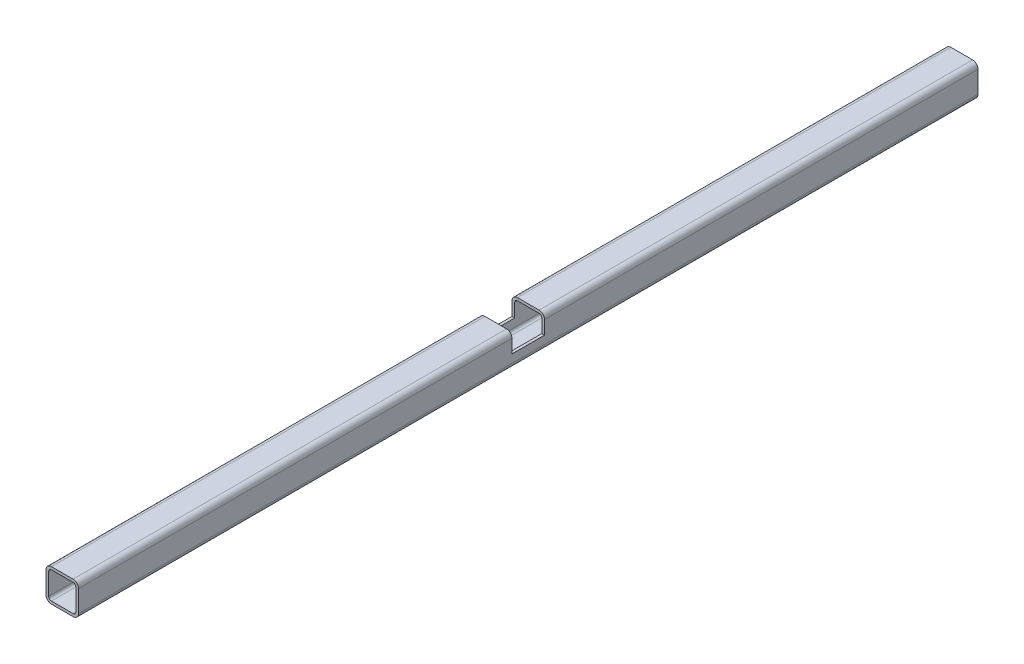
ISO-10303-21;
HEADER;
FILE_DESCRIPTION(('STEP AP214'),'2;1');
FILE_NAME('part.step','',(''),(''),'','','');
FILE_SCHEMA(('AUTOMOTIVE_DESIGN { 1 0 10303 214 1 1 1 1 }'));
ENDSEC;
DATA;
#1=APPLICATION_CONTEXT('core data for automotive mechanical design processes');
#2=APPLICATION_PROTOCOL_DEFINITION('international standard','automotive_design',2000,#1);
#3=PRODUCT_CONTEXT('',#1,'mechanical');
#4=PRODUCT('Part','Part','',(#3));
#5=PRODUCT_RELATED_PRODUCT_CATEGORY('part','',(#4));
#6=PRODUCT_DEFINITION_FORMATION('','',#4);
#7=PRODUCT_DEFINITION_CONTEXT('part definition',#1,'design');
#8=PRODUCT_DEFINITION('design','',#6,#7);
#9=PRODUCT_DEFINITION_SHAPE('','',#8);
#10=(LENGTH_UNIT() NAMED_UNIT(*) SI_UNIT(.MILLI.,.METRE.));
#11=(NAMED_UNIT(*) PLANE_ANGLE_UNIT() SI_UNIT($,.RADIAN.));
#12=(NAMED_UNIT(*) SI_UNIT($,.STERADIAN.) SOLID_ANGLE_UNIT());
#13=UNCERTAINTY_MEASURE_WITH_UNIT(LENGTH_MEASURE(1.E-05),#10,'distance_accuracy_value','');
#14=(GEOMETRIC_REPRESENTATION_CONTEXT(3) GLOBAL_UNCERTAINTY_ASSIGNED_CONTEXT((#13)) GLOBAL_UNIT_ASSIGNED_CONTEXT((#10,
#11,#12)) REPRESENTATION_CONTEXT('',''));
#15=CARTESIAN_POINT('',(0.,0.,0.));
#16=DIRECTION('',(0.,0.,1.));
#17=DIRECTION('',(1.,0.,0.));
#18=AXIS2_PLACEMENT_3D('',#15,#16,#17);
#19=CARTESIAN_POINT('',(20.,20.,1660.));
#20=DIRECTION('',(0.,0.,-1.));
#21=DIRECTION('',(-1.,0.,0.));
#22=AXIS2_PLACEMENT_3D('',#19,#20,#21);
#23=CYLINDRICAL_SURFACE('',#22,10.);
#24=DIRECTION('',(0.,0.,-1.));
#25=VECTOR('',#24,1.);
#26=CARTESIAN_POINT('',(20.,30.,1660.));
#27=LINE('',#26,#25);
#28=CARTESIAN_POINT('',(20.,30.,800.));
#29=VERTEX_POINT('',#28);
#30=CARTESIAN_POINT('',(20.,30.,0.));
#31=VERTEX_POINT('',#30);
#32=EDGE_CURVE('E406',#29,#31,#27,.T.);
#33=ORIENTED_EDGE('',*,*,#32,.F.);
#34=CARTESIAN_POINT('',(20.,20.,800.));
#35=DIRECTION('',(0.,0.,-1.));
#36=DIRECTION('',(-1.,0.,0.));
#37=AXIS2_PLACEMENT_3D('',#34,#35,#36);
#38=CIRCLE('',#37,10.);
#39=CARTESIAN_POINT('',(30.,20.,800.));
#40=VERTEX_POINT('',#39);
#41=EDGE_CURVE('E278',#29,#40,#38,.T.);
#42=ORIENTED_EDGE('',*,*,#41,.T.);
#43=DIRECTION('',(0.,0.,-1.));
#44=VECTOR('',#43,1.);
#45=CARTESIAN_POINT('',(30.,20.,1660.));
#46=LINE('',#45,#44);
#47=CARTESIAN_POINT('',(30.,20.,0.));
#48=VERTEX_POINT('',#47);
#49=EDGE_CURVE('E237',#40,#48,#46,.T.);
#50=ORIENTED_EDGE('',*,*,#49,.T.);
#51=CARTESIAN_POINT('',(20.,20.,0.));
#52=DIRECTION('',(0.,0.,1.));
#53=DIRECTION('',(1.,0.,0.));
#54=AXIS2_PLACEMENT_3D('',#51,#52,#53);
#55=CIRCLE('',#54,10.);
#56=EDGE_CURVE('E347',#48,#31,#55,.T.);
#57=ORIENTED_EDGE('',*,*,#56,.T.);
#58=EDGE_LOOP('',(#33,#42,#50,#57));
#59=FACE_BOUND('',#58,.T.);
#60=ADVANCED_FACE('F32',(#59),#23,.T.);
#61=CARTESIAN_POINT('',(20.,30.,1660.));
#62=DIRECTION('',(0.,-1.,0.));
#63=DIRECTION('',(1.,0.,0.));
#64=AXIS2_PLACEMENT_3D('',#61,#62,#63);
#65=PLANE('',#64);
#66=DIRECTION('',(0.,0.,-1.));
#67=VECTOR('',#66,1.);
#68=CARTESIAN_POINT('',(-20.,30.,1660.));
#69=LINE('',#68,#67);
#70=CARTESIAN_POINT('',(-20.,30.,800.));
#71=VERTEX_POINT('',#70);
#72=CARTESIAN_POINT('',(-20.,30.,0.));
#73=VERTEX_POINT('',#72);
#74=EDGE_CURVE('E402',#71,#73,#69,.T.);
#75=ORIENTED_EDGE('',*,*,#74,.F.);
#76=DIRECTION('',(-1.,0.,0.));
#77=VECTOR('',#76,1.);
#78=CARTESIAN_POINT('',(30.,30.,800.));
#79=LINE('',#78,#77);
#80=EDGE_CURVE('E249',#29,#71,#79,.T.);
#81=ORIENTED_EDGE('',*,*,#80,.F.);
#82=ORIENTED_EDGE('',*,*,#32,.T.);
#83=DIRECTION('',(-1.,0.,0.));
#84=VECTOR('',#83,1.);
#85=CARTESIAN_POINT('',(20.,30.,0.));
#86=LINE('',#85,#84);
#87=EDGE_CURVE('E368',#31,#73,#86,.T.);
#88=ORIENTED_EDGE('',*,*,#87,.T.);
#89=EDGE_LOOP('',(#75,#81,#82,#88));
#90=FACE_BOUND('',#89,.T.);
#91=ADVANCED_FACE('F501',(#90),#65,.F.);
#92=CARTESIAN_POINT('',(-20.,20.,1660.));
#93=DIRECTION('',(0.,0.,-1.));
#94=DIRECTION('',(-1.,0.,0.));
#95=AXIS2_PLACEMENT_3D('',#92,#93,#94);
#96=CYLINDRICAL_SURFACE('',#95,10.);
#97=DIRECTION('',(0.,0.,-1.));
#98=VECTOR('',#97,1.);
#99=CARTESIAN_POINT('',(-30.,20.,1660.));
#100=LINE('',#99,#98);
#101=CARTESIAN_POINT('',(-30.,20.,800.));
#102=VERTEX_POINT('',#101);
#103=CARTESIAN_POINT('',(-30.,20.,0.));
#104=VERTEX_POINT('',#103);
#105=EDGE_CURVE('E398',#102,#104,#100,.T.);
#106=ORIENTED_EDGE('',*,*,#105,.F.);
#107=CARTESIAN_POINT('',(-20.,20.,800.));
#108=DIRECTION('',(0.,0.,-1.));
#109=DIRECTION('',(-1.,0.,0.));
#110=AXIS2_PLACEMENT_3D('',#107,#108,#109);
#111=CIRCLE('',#110,10.);
#112=EDGE_CURVE('E275',#102,#71,#111,.T.);
#113=ORIENTED_EDGE('',*,*,#112,.T.);
#114=ORIENTED_EDGE('',*,*,#74,.T.);
#115=CARTESIAN_POINT('',(-20.,20.,0.));
#116=DIRECTION('',(0.,0.,1.));
#117=DIRECTION('',(1.,0.,0.));
#118=AXIS2_PLACEMENT_3D('',#115,#116,#117);
#119=CIRCLE('',#118,10.);
#120=EDGE_CURVE('E371',#73,#104,#119,.T.);
#121=ORIENTED_EDGE('',*,*,#120,.T.);
#122=EDGE_LOOP('',(#106,#113,#114,#121));
#123=FACE_BOUND('',#122,.T.);
#124=ADVANCED_FACE('F503',(#123),#96,.T.);
#125=CARTESIAN_POINT('',(-20.,20.,1660.));
#126=DIRECTION('',(0.,0.,-1.));
#127=DIRECTION('',(-1.,0.,0.));
#128=AXIS2_PLACEMENT_3D('',#125,#126,#127);
#129=CYLINDRICAL_SURFACE('',#128,5.00000000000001);
#130=CARTESIAN_POINT('',(-20.,20.,800.));
#131=DIRECTION('',(0.,0.,-1.));
#132=DIRECTION('',(-1.,0.,0.));
#133=AXIS2_PLACEMENT_3D('',#130,#131,#132);
#134=CIRCLE('',#133,5.00000000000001);
#135=CARTESIAN_POINT('',(-25.,20.,800.));
#136=VERTEX_POINT('',#135);
#137=CARTESIAN_POINT('',(-20.,25.,800.));
#138=VERTEX_POINT('',#137);
#139=EDGE_CURVE('E271',#136,#138,#134,.T.);
#140=ORIENTED_EDGE('',*,*,#139,.F.);
#141=DIRECTION('',(0.,0.,-1.));
#142=VECTOR('',#141,1.);
#143=CARTESIAN_POINT('',(-25.,20.,1660.));
#144=LINE('',#143,#142);
#145=CARTESIAN_POINT('',(-25.,20.,0.));
#146=VERTEX_POINT('',#145);
#147=EDGE_CURVE('E343',#136,#146,#144,.T.);
#148=ORIENTED_EDGE('',*,*,#147,.T.);
#149=CARTESIAN_POINT('',(-20.,20.,0.));
#150=DIRECTION('',(0.,0.,1.));
#151=DIRECTION('',(1.,0.,0.));
#152=AXIS2_PLACEMENT_3D('',#149,#150,#151);
#153=CIRCLE('',#152,5.00000000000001);
#154=CARTESIAN_POINT('',(-20.,25.,0.));
#155=VERTEX_POINT('',#154);
#156=EDGE_CURVE('E282',#155,#146,#153,.T.);
#157=ORIENTED_EDGE('',*,*,#156,.F.);
#158=DIRECTION('',(0.,0.,-1.));
#159=VECTOR('',#158,1.);
#160=CARTESIAN_POINT('',(-20.,25.,1660.));
#161=LINE('',#160,#159);
#162=EDGE_CURVE('E301',#138,#155,#161,.T.);
#163=ORIENTED_EDGE('',*,*,#162,.F.);
#164=EDGE_LOOP('',(#140,#148,#157,#163));
#165=FACE_BOUND('',#164,.T.);
#166=ADVANCED_FACE('F540',(#165),#129,.F.);
#167=CARTESIAN_POINT('',(20.,20.,1660.));
#168=DIRECTION('',(0.,0.,-1.));
#169=DIRECTION('',(-1.,0.,0.));
#170=AXIS2_PLACEMENT_3D('',#167,#168,#169);
#171=CYLINDRICAL_SURFACE('',#170,5.00000000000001);
#172=CARTESIAN_POINT('',(20.,20.,800.));
#173=DIRECTION('',(0.,0.,-1.));
#174=DIRECTION('',(-1.,0.,0.));
#175=AXIS2_PLACEMENT_3D('',#172,#173,#174);
#176=CIRCLE('',#175,5.00000000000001);
#177=CARTESIAN_POINT('',(20.,25.,800.));
#178=VERTEX_POINT('',#177);
#179=CARTESIAN_POINT('',(25.,20.,800.));
#180=VERTEX_POINT('',#179);
#181=EDGE_CURVE('E268',#178,#180,#176,.T.);
#182=ORIENTED_EDGE('',*,*,#181,.F.);
#183=DIRECTION('',(0.,0.,-1.));
#184=VECTOR('',#183,1.);
#185=CARTESIAN_POINT('',(20.,25.,1660.));
#186=LINE('',#185,#184);
#187=CARTESIAN_POINT('',(20.,25.,0.));
#188=VERTEX_POINT('',#187);
#189=EDGE_CURVE('E327',#178,#188,#186,.T.);
#190=ORIENTED_EDGE('',*,*,#189,.T.);
#191=CARTESIAN_POINT('',(20.,20.,0.));
#192=DIRECTION('',(0.,0.,1.));
#193=DIRECTION('',(1.,0.,0.));
#194=AXIS2_PLACEMENT_3D('',#191,#192,#193);
#195=CIRCLE('',#194,5.00000000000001);
#196=CARTESIAN_POINT('',(25.,20.,0.));
#197=VERTEX_POINT('',#196);
#198=EDGE_CURVE('E319',#197,#188,#195,.T.);
#199=ORIENTED_EDGE('',*,*,#198,.F.);
#200=DIRECTION('',(0.,0.,-1.));
#201=VECTOR('',#200,1.);
#202=CARTESIAN_POINT('',(25.,20.,1660.));
#203=LINE('',#202,#201);
#204=EDGE_CURVE('E331',#180,#197,#203,.T.);
#205=ORIENTED_EDGE('',*,*,#204,.F.);
#206=EDGE_LOOP('',(#182,#190,#199,#205));
#207=FACE_BOUND('',#206,.T.);
#208=ADVANCED_FACE('F419',(#207),#171,.F.);
#209=CARTESIAN_POINT('',(20.,25.,1660.));
#210=DIRECTION('',(0.,-1.,0.));
#211=DIRECTION('',(1.,0.,0.));
#212=AXIS2_PLACEMENT_3D('',#209,#210,#211);
#213=PLANE('',#212);
#214=DIRECTION('',(1.,0.,0.));
#215=VECTOR('',#214,1.);
#216=CARTESIAN_POINT('',(20.,25.,800.));
#217=LINE('',#216,#215);
#218=EDGE_CURVE('E40',#138,#178,#217,.T.);
#219=ORIENTED_EDGE('',*,*,#218,.F.);
#220=ORIENTED_EDGE('',*,*,#162,.T.);
#221=DIRECTION('',(-1.,0.,0.));
#222=VECTOR('',#221,1.);
#223=CARTESIAN_POINT('',(20.,25.,0.));
#224=LINE('',#223,#222);
#225=EDGE_CURVE('E286',#188,#155,#224,.T.);
#226=ORIENTED_EDGE('',*,*,#225,.F.);
#227=ORIENTED_EDGE('',*,*,#189,.F.);
#228=EDGE_LOOP('',(#219,#220,#226,#227));
#229=FACE_BOUND('',#228,.T.);
#230=ADVANCED_FACE('F422',(#229),#213,.T.);
#231=CARTESIAN_POINT('',(20.,20.,1660.));
#232=DIRECTION('',(0.,0.,1.));
#233=DIRECTION('',(1.,0.,0.));
#234=AXIS2_PLACEMENT_3D('',#231,#232,#233);
#235=PLANE('',#234);
#236=CARTESIAN_POINT('',(20.,20.,1660.));
#237=DIRECTION('',(0.,0.,1.));
#238=DIRECTION('',(1.,0.,0.));
#239=AXIS2_PLACEMENT_3D('',#236,#237,#238);
#240=CIRCLE('',#239,10.);
#241=CARTESIAN_POINT('',(30.,20.,1660.));
#242=VERTEX_POINT('',#241);
#243=CARTESIAN_POINT('',(20.,30.,1660.));
#244=VERTEX_POINT('',#243);
#245=EDGE_CURVE('E348',#242,#244,#240,.T.);
#246=ORIENTED_EDGE('',*,*,#245,.T.);
#247=DIRECTION('',(-1.,0.,0.));
#248=VECTOR('',#247,1.);
#249=CARTESIAN_POINT('',(20.,30.,1660.));
#250=LINE('',#249,#248);
#251=CARTESIAN_POINT('',(-20.,30.,1660.));
#252=VERTEX_POINT('',#251);
#253=EDGE_CURVE('E351',#244,#252,#250,.T.);
#254=ORIENTED_EDGE('',*,*,#253,.T.);
#255=CARTESIAN_POINT('',(-20.,20.,1660.));
#256=DIRECTION('',(0.,0.,1.));
#257=DIRECTION('',(1.,0.,0.));
#258=AXIS2_PLACEMENT_3D('',#255,#256,#257);
#259=CIRCLE('',#258,10.);
#260=CARTESIAN_POINT('',(-30.,20.,1660.));
#261=VERTEX_POINT('',#260);
#262=EDGE_CURVE('E354',#252,#261,#259,.T.);
#263=ORIENTED_EDGE('',*,*,#262,.T.);
#264=DIRECTION('',(0.,-1.,0.));
#265=VECTOR('',#264,1.);
#266=CARTESIAN_POINT('',(-30.,-20.,1660.));
#267=LINE('',#266,#265);
#268=CARTESIAN_POINT('',(-30.,-20.,1660.));
#269=VERTEX_POINT('',#268);
#270=EDGE_CURVE('E356',#261,#269,#267,.T.);
#271=ORIENTED_EDGE('',*,*,#270,.T.);
#272=CARTESIAN_POINT('',(-20.,-20.,1660.));
#273=DIRECTION('',(0.,0.,1.));
#274=DIRECTION('',(1.,0.,0.));
#275=AXIS2_PLACEMENT_3D('',#272,#273,#274);
#276=CIRCLE('',#275,10.);
#277=CARTESIAN_POINT('',(-20.,-30.,1660.));
#278=VERTEX_POINT('',#277);
#279=EDGE_CURVE('E358',#269,#278,#276,.T.);
#280=ORIENTED_EDGE('',*,*,#279,.T.);
#281=DIRECTION('',(1.,0.,0.));
#282=VECTOR('',#281,1.);
#283=CARTESIAN_POINT('',(-20.,-30.,1660.));
#284=LINE('',#283,#282);
#285=CARTESIAN_POINT('',(20.,-30.,1660.));
#286=VERTEX_POINT('',#285);
#287=EDGE_CURVE('E360',#278,#286,#284,.T.);
#288=ORIENTED_EDGE('',*,*,#287,.T.);
#289=CARTESIAN_POINT('',(20.,-20.,1660.));
#290=DIRECTION('',(0.,0.,1.));
#291=DIRECTION('',(1.,0.,0.));
#292=AXIS2_PLACEMENT_3D('',#289,#290,#291);
#293=CIRCLE('',#292,10.);
#294=CARTESIAN_POINT('',(30.,-20.,1660.));
#295=VERTEX_POINT('',#294);
#296=EDGE_CURVE('E362',#286,#295,#293,.T.);
#297=ORIENTED_EDGE('',*,*,#296,.T.);
#298=DIRECTION('',(0.,1.,0.));
#299=VECTOR('',#298,1.);
#300=CARTESIAN_POINT('',(30.,20.,1660.));
#301=LINE('',#300,#299);
#302=EDGE_CURVE('E364',#295,#242,#301,.T.);
#303=ORIENTED_EDGE('',*,*,#302,.T.);
#304=EDGE_LOOP('',(#246,#254,#263,#271,#280,#288,#297,#303));
#305=FACE_BOUND('',#304,.T.);
#306=DIRECTION('',(0.,-1.,0.));
#307=VECTOR('',#306,1.);
#308=CARTESIAN_POINT('',(-25.,-20.,1660.));
#309=LINE('',#308,#307);
#310=CARTESIAN_POINT('',(-25.,20.,1660.));
#311=VERTEX_POINT('',#310);
#312=CARTESIAN_POINT('',(-25.,-20.,1660.));
#313=VERTEX_POINT('',#312);
#314=EDGE_CURVE('E285',#311,#313,#309,.T.);
#315=ORIENTED_EDGE('',*,*,#314,.F.);
#316=CARTESIAN_POINT('',(-20.,20.,1660.));
#317=DIRECTION('',(0.,0.,1.));
#318=DIRECTION('',(1.,0.,0.));
#319=AXIS2_PLACEMENT_3D('',#316,#317,#318);
#320=CIRCLE('',#319,5.00000000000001);
#321=CARTESIAN_POINT('',(-20.,25.,1660.));
#322=VERTEX_POINT('',#321);
#323=EDGE_CURVE('E283',#322,#311,#320,.T.);
#324=ORIENTED_EDGE('',*,*,#323,.F.);
#325=DIRECTION('',(-1.,0.,0.));
#326=VECTOR('',#325,1.);
#327=CARTESIAN_POINT('',(20.,25.,1660.));
#328=LINE('',#327,#326);
#329=CARTESIAN_POINT('',(20.,25.,1660.));
#330=VERTEX_POINT('',#329);
#331=EDGE_CURVE('E299',#330,#322,#328,.T.);
#332=ORIENTED_EDGE('',*,*,#331,.F.);
#333=CARTESIAN_POINT('',(20.,20.,1660.));
#334=DIRECTION('',(0.,0.,1.));
#335=DIRECTION('',(1.,0.,0.));
#336=AXIS2_PLACEMENT_3D('',#333,#334,#335);
#337=CIRCLE('',#336,5.00000000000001);
#338=CARTESIAN_POINT('',(25.,20.,1660.));
#339=VERTEX_POINT('',#338);
#340=EDGE_CURVE('E296',#339,#330,#337,.T.);
#341=ORIENTED_EDGE('',*,*,#340,.F.);
#342=DIRECTION('',(0.,1.,0.));
#343=VECTOR('',#342,1.);
#344=CARTESIAN_POINT('',(25.,20.,1660.));
#345=LINE('',#344,#343);
#346=CARTESIAN_POINT('',(25.,-20.,1660.));
#347=VERTEX_POINT('',#346);
#348=EDGE_CURVE('E294',#347,#339,#345,.T.);
#349=ORIENTED_EDGE('',*,*,#348,.F.);
#350=CARTESIAN_POINT('',(20.,-20.,1660.));
#351=DIRECTION('',(0.,0.,1.));
#352=DIRECTION('',(1.,0.,0.));
#353=AXIS2_PLACEMENT_3D('',#350,#351,#352);
#354=CIRCLE('',#353,5.00000000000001);
#355=CARTESIAN_POINT('',(20.,-25.,1660.));
#356=VERTEX_POINT('',#355);
#357=EDGE_CURVE('E292',#356,#347,#354,.T.);
#358=ORIENTED_EDGE('',*,*,#357,.F.);
#359=DIRECTION('',(1.,0.,0.));
#360=VECTOR('',#359,1.);
#361=CARTESIAN_POINT('',(-20.,-25.,1660.));
#362=LINE('',#361,#360);
#363=CARTESIAN_POINT('',(-20.,-25.,1660.));
#364=VERTEX_POINT('',#363);
#365=EDGE_CURVE('E290',#364,#356,#362,.T.);
#366=ORIENTED_EDGE('',*,*,#365,.F.);
#367=CARTESIAN_POINT('',(-20.,-20.,1660.));
#368=DIRECTION('',(0.,0.,1.));
#369=DIRECTION('',(1.,0.,0.));
#370=AXIS2_PLACEMENT_3D('',#367,#368,#369);
#371=CIRCLE('',#370,5.);
#372=EDGE_CURVE('E288',#313,#364,#371,.T.);
#373=ORIENTED_EDGE('',*,*,#372,.F.);
#374=EDGE_LOOP('',(#315,#324,#332,#341,#349,#358,#366,#373));
#375=FACE_BOUND('',#374,.T.);
#376=ADVANCED_FACE('F441',(#305,#375),#235,.T.);
#377=CARTESIAN_POINT('',(20.,20.,0.));
#378=DIRECTION('',(0.,0.,1.));
#379=DIRECTION('',(1.,0.,0.));
#380=AXIS2_PLACEMENT_3D('',#377,#378,#379);
#381=PLANE('',#380);
#382=ORIENTED_EDGE('',*,*,#56,.F.);
#383=DIRECTION('',(0.,1.,0.));
#384=VECTOR('',#383,1.);
#385=CARTESIAN_POINT('',(30.,20.,0.));
#386=LINE('',#385,#384);
#387=CARTESIAN_POINT('',(30.,-20.,0.));
#388=VERTEX_POINT('',#387);
#389=EDGE_CURVE('E352',#388,#48,#386,.T.);
#390=ORIENTED_EDGE('',*,*,#389,.F.);
#391=CARTESIAN_POINT('',(20.,-20.,0.));
#392=DIRECTION('',(0.,0.,1.));
#393=DIRECTION('',(1.,0.,0.));
#394=AXIS2_PLACEMENT_3D('',#391,#392,#393);
#395=CIRCLE('',#394,10.);
#396=CARTESIAN_POINT('',(20.,-30.,0.));
#397=VERTEX_POINT('',#396);
#398=EDGE_CURVE('E380',#397,#388,#395,.T.);
#399=ORIENTED_EDGE('',*,*,#398,.F.);
#400=DIRECTION('',(1.,0.,0.));
#401=VECTOR('',#400,1.);
#402=CARTESIAN_POINT('',(-20.,-30.,0.));
#403=LINE('',#402,#401);
#404=CARTESIAN_POINT('',(-20.,-30.,0.));
#405=VERTEX_POINT('',#404);
#406=EDGE_CURVE('E378',#405,#397,#403,.T.);
#407=ORIENTED_EDGE('',*,*,#406,.F.);
#408=CARTESIAN_POINT('',(-20.,-20.,0.));
#409=DIRECTION('',(0.,0.,1.));
#410=DIRECTION('',(1.,0.,0.));
#411=AXIS2_PLACEMENT_3D('',#408,#409,#410);
#412=CIRCLE('',#411,10.);
#413=CARTESIAN_POINT('',(-30.,-20.,0.));
#414=VERTEX_POINT('',#413);
#415=EDGE_CURVE('E376',#414,#405,#412,.T.);
#416=ORIENTED_EDGE('',*,*,#415,.F.);
#417=DIRECTION('',(0.,-1.,0.));
#418=VECTOR('',#417,1.);
#419=CARTESIAN_POINT('',(-30.,-20.,0.));
#420=LINE('',#419,#418);
#421=EDGE_CURVE('E374',#104,#414,#420,.T.);
#422=ORIENTED_EDGE('',*,*,#421,.F.);
#423=ORIENTED_EDGE('',*,*,#120,.F.);
#424=ORIENTED_EDGE('',*,*,#87,.F.);
#425=EDGE_LOOP('',(#382,#390,#399,#407,#416,#422,#423,#424));
#426=FACE_BOUND('',#425,.T.);
#427=ORIENTED_EDGE('',*,*,#156,.T.);
#428=DIRECTION('',(0.,-1.,0.));
#429=VECTOR('',#428,1.);
#430=CARTESIAN_POINT('',(-25.,-20.,0.));
#431=LINE('',#430,#429);
#432=CARTESIAN_POINT('',(-25.,-20.,0.));
#433=VERTEX_POINT('',#432);
#434=EDGE_CURVE('E304',#146,#433,#431,.T.);
#435=ORIENTED_EDGE('',*,*,#434,.T.);
#436=CARTESIAN_POINT('',(-20.,-20.,0.));
#437=DIRECTION('',(0.,0.,1.));
#438=DIRECTION('',(1.,0.,0.));
#439=AXIS2_PLACEMENT_3D('',#436,#437,#438);
#440=CIRCLE('',#439,5.);
#441=CARTESIAN_POINT('',(-20.,-25.,0.));
#442=VERTEX_POINT('',#441);
#443=EDGE_CURVE('E307',#433,#442,#440,.T.);
#444=ORIENTED_EDGE('',*,*,#443,.T.);
#445=DIRECTION('',(1.,0.,0.));
#446=VECTOR('',#445,1.);
#447=CARTESIAN_POINT('',(-20.,-25.,0.));
#448=LINE('',#447,#446);
#449=CARTESIAN_POINT('',(20.,-25.,0.));
#450=VERTEX_POINT('',#449);
#451=EDGE_CURVE('E310',#442,#450,#448,.T.);
#452=ORIENTED_EDGE('',*,*,#451,.T.);
#453=CARTESIAN_POINT('',(20.,-20.,0.));
#454=DIRECTION('',(0.,0.,1.));
#455=DIRECTION('',(1.,0.,0.));
#456=AXIS2_PLACEMENT_3D('',#453,#454,#455);
#457=CIRCLE('',#456,5.00000000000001);
#458=CARTESIAN_POINT('',(25.,-20.,0.));
#459=VERTEX_POINT('',#458);
#460=EDGE_CURVE('E313',#450,#459,#457,.T.);
#461=ORIENTED_EDGE('',*,*,#460,.T.);
#462=DIRECTION('',(0.,1.,0.));
#463=VECTOR('',#462,1.);
#464=CARTESIAN_POINT('',(25.,20.,0.));
#465=LINE('',#464,#463);
#466=EDGE_CURVE('E316',#459,#197,#465,.T.);
#467=ORIENTED_EDGE('',*,*,#466,.T.);
#468=ORIENTED_EDGE('',*,*,#198,.T.);
#469=ORIENTED_EDGE('',*,*,#225,.T.);
#470=EDGE_LOOP('',(#427,#435,#444,#452,#461,#467,#468,#469));
#471=FACE_BOUND('',#470,.T.);
#472=ADVANCED_FACE('F425',(#426,#471),#381,.F.);
#473=CARTESIAN_POINT('',(30.,20.,860.));
#474=VERTEX_POINT('',#473);
#475=EDGE_CURVE('E383',#242,#474,#46,.T.);
#476=ORIENTED_EDGE('',*,*,#475,.T.);
#477=CARTESIAN_POINT('',(20.,20.,860.));
#478=DIRECTION('',(0.,0.,1.));
#479=DIRECTION('',(1.,0.,0.));
#480=AXIS2_PLACEMENT_3D('',#477,#478,#479);
#481=CIRCLE('',#480,10.);
#482=CARTESIAN_POINT('',(20.,30.,860.));
#483=VERTEX_POINT('',#482);
#484=EDGE_CURVE('E265',#474,#483,#481,.T.);
#485=ORIENTED_EDGE('',*,*,#484,.T.);
#486=EDGE_CURVE('E407',#244,#483,#27,.T.);
#487=ORIENTED_EDGE('',*,*,#486,.F.);
#488=ORIENTED_EDGE('',*,*,#245,.F.);
#489=EDGE_LOOP('',(#476,#485,#487,#488));
#490=FACE_BOUND('',#489,.T.);
#491=ADVANCED_FACE('F34',(#490),#23,.T.);
#492=ORIENTED_EDGE('',*,*,#486,.T.);
#493=DIRECTION('',(-1.,0.,0.));
#494=VECTOR('',#493,1.);
#495=CARTESIAN_POINT('',(30.,30.,860.));
#496=LINE('',#495,#494);
#497=CARTESIAN_POINT('',(-20.,30.,860.));
#498=VERTEX_POINT('',#497);
#499=EDGE_CURVE('E251',#483,#498,#496,.T.);
#500=ORIENTED_EDGE('',*,*,#499,.T.);
#501=EDGE_CURVE('E403',#252,#498,#69,.T.);
#502=ORIENTED_EDGE('',*,*,#501,.F.);
#503=ORIENTED_EDGE('',*,*,#253,.F.);
#504=EDGE_LOOP('',(#492,#500,#502,#503));
#505=FACE_BOUND('',#504,.T.);
#506=ADVANCED_FACE('F475',(#505),#65,.F.);
#507=ORIENTED_EDGE('',*,*,#501,.T.);
#508=CARTESIAN_POINT('',(-20.,20.,860.));
#509=DIRECTION('',(0.,0.,1.));
#510=DIRECTION('',(1.,0.,0.));
#511=AXIS2_PLACEMENT_3D('',#508,#509,#510);
#512=CIRCLE('',#511,10.);
#513=CARTESIAN_POINT('',(-30.,20.,860.));
#514=VERTEX_POINT('',#513);
#515=EDGE_CURVE('E262',#498,#514,#512,.T.);
#516=ORIENTED_EDGE('',*,*,#515,.T.);
#517=EDGE_CURVE('E399',#261,#514,#100,.T.);
#518=ORIENTED_EDGE('',*,*,#517,.F.);
#519=ORIENTED_EDGE('',*,*,#262,.F.);
#520=EDGE_LOOP('',(#507,#516,#518,#519));
#521=FACE_BOUND('',#520,.T.);
#522=ADVANCED_FACE('F471',(#521),#96,.T.);
#523=CARTESIAN_POINT('',(-30.,-20.,1660.));
#524=DIRECTION('',(1.,0.,0.));
#525=DIRECTION('',(0.,1.,0.));
#526=AXIS2_PLACEMENT_3D('',#523,#524,#525);
#527=PLANE('',#526);
#528=DIRECTION('',(0.,0.,1.));
#529=VECTOR('',#528,1.);
#530=CARTESIAN_POINT('',(-30.,-5.00000000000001,800.));
#531=LINE('',#530,#529);
#532=CARTESIAN_POINT('',(-30.,-5.00000000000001,800.));
#533=VERTEX_POINT('',#532);
#534=CARTESIAN_POINT('',(-30.,-5.00000000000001,860.));
#535=VERTEX_POINT('',#534);
#536=EDGE_CURVE('E240',#533,#535,#531,.T.);
#537=ORIENTED_EDGE('',*,*,#536,.F.);
#538=DIRECTION('',(0.,-1.,0.));
#539=VECTOR('',#538,1.);
#540=CARTESIAN_POINT('',(-30.,-5.00000000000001,800.));
#541=LINE('',#540,#539);
#542=EDGE_CURVE('E244',#102,#533,#541,.T.);
#543=ORIENTED_EDGE('',*,*,#542,.F.);
#544=ORIENTED_EDGE('',*,*,#105,.T.);
#545=ORIENTED_EDGE('',*,*,#421,.T.);
#546=DIRECTION('',(0.,0.,-1.));
#547=VECTOR('',#546,1.);
#548=CARTESIAN_POINT('',(-30.,-20.,1660.));
#549=LINE('',#548,#547);
#550=EDGE_CURVE('E395',#269,#414,#549,.T.);
#551=ORIENTED_EDGE('',*,*,#550,.F.);
#552=ORIENTED_EDGE('',*,*,#270,.F.);
#553=ORIENTED_EDGE('',*,*,#517,.T.);
#554=DIRECTION('',(0.,1.,0.));
#555=VECTOR('',#554,1.);
#556=CARTESIAN_POINT('',(-30.,-5.00000000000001,860.));
#557=LINE('',#556,#555);
#558=EDGE_CURVE('E238',#535,#514,#557,.T.);
#559=ORIENTED_EDGE('',*,*,#558,.F.);
#560=EDGE_LOOP('',(#537,#543,#544,#545,#551,#552,#553,#559));
#561=FACE_BOUND('',#560,.T.);
#562=ADVANCED_FACE('F467',(#561),#527,.F.);
#563=CARTESIAN_POINT('',(-20.,-20.,1660.));
#564=DIRECTION('',(0.,0.,-1.));
#565=DIRECTION('',(-1.,0.,0.));
#566=AXIS2_PLACEMENT_3D('',#563,#564,#565);
#567=CYLINDRICAL_SURFACE('',#566,10.);
#568=ORIENTED_EDGE('',*,*,#415,.T.);
#569=DIRECTION('',(0.,0.,-1.));
#570=VECTOR('',#569,1.);
#571=CARTESIAN_POINT('',(-20.,-30.,1660.));
#572=LINE('',#571,#570);
#573=EDGE_CURVE('E392',#278,#405,#572,.T.);
#574=ORIENTED_EDGE('',*,*,#573,.F.);
#575=ORIENTED_EDGE('',*,*,#279,.F.);
#576=ORIENTED_EDGE('',*,*,#550,.T.);
#577=EDGE_LOOP('',(#568,#574,#575,#576));
#578=FACE_BOUND('',#577,.T.);
#579=ADVANCED_FACE('F508',(#578),#567,.T.);
#580=CARTESIAN_POINT('',(-20.,-30.,1660.));
#581=DIRECTION('',(0.,1.,0.));
#582=DIRECTION('',(-1.,0.,0.));
#583=AXIS2_PLACEMENT_3D('',#580,#581,#582);
#584=PLANE('',#583);
#585=ORIENTED_EDGE('',*,*,#406,.T.);
#586=DIRECTION('',(0.,0.,-1.));
#587=VECTOR('',#586,1.);
#588=CARTESIAN_POINT('',(20.,-30.,1660.));
#589=LINE('',#588,#587);
#590=EDGE_CURVE('E389',#286,#397,#589,.T.);
#591=ORIENTED_EDGE('',*,*,#590,.F.);
#592=ORIENTED_EDGE('',*,*,#287,.F.);
#593=ORIENTED_EDGE('',*,*,#573,.T.);
#594=EDGE_LOOP('',(#585,#591,#592,#593));
#595=FACE_BOUND('',#594,.T.);
#596=ADVANCED_FACE('F511',(#595),#584,.F.);
#597=CARTESIAN_POINT('',(20.,-20.,1660.));
#598=DIRECTION('',(0.,0.,-1.));
#599=DIRECTION('',(-1.,0.,0.));
#600=AXIS2_PLACEMENT_3D('',#597,#598,#599);
#601=CYLINDRICAL_SURFACE('',#600,10.);
#602=ORIENTED_EDGE('',*,*,#398,.T.);
#603=DIRECTION('',(0.,0.,-1.));
#604=VECTOR('',#603,1.);
#605=CARTESIAN_POINT('',(30.,-20.,1660.));
#606=LINE('',#605,#604);
#607=EDGE_CURVE('E386',#295,#388,#606,.T.);
#608=ORIENTED_EDGE('',*,*,#607,.F.);
#609=ORIENTED_EDGE('',*,*,#296,.F.);
#610=ORIENTED_EDGE('',*,*,#590,.T.);
#611=EDGE_LOOP('',(#602,#608,#609,#610));
#612=FACE_BOUND('',#611,.T.);
#613=ADVANCED_FACE('F488',(#612),#601,.T.);
#614=CARTESIAN_POINT('',(30.,20.,1660.));
#615=DIRECTION('',(-1.,0.,0.));
#616=DIRECTION('',(0.,0.,1.));
#617=AXIS2_PLACEMENT_3D('',#614,#615,#616);
#618=PLANE('',#617);
#619=ORIENTED_EDGE('',*,*,#49,.F.);
#620=DIRECTION('',(0.,-1.,0.));
#621=VECTOR('',#620,1.);
#622=CARTESIAN_POINT('',(30.,-4.99999999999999,800.));
#623=LINE('',#622,#621);
#624=CARTESIAN_POINT('',(30.,-4.99999999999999,800.));
#625=VERTEX_POINT('',#624);
#626=EDGE_CURVE('E219',#40,#625,#623,.T.);
#627=ORIENTED_EDGE('',*,*,#626,.T.);
#628=DIRECTION('',(0.,0.,1.));
#629=VECTOR('',#628,1.);
#630=CARTESIAN_POINT('',(30.,-4.99999999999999,800.));
#631=LINE('',#630,#629);
#632=CARTESIAN_POINT('',(30.,-4.99999999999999,860.));
#633=VERTEX_POINT('',#632);
#634=EDGE_CURVE('E229',#625,#633,#631,.T.);
#635=ORIENTED_EDGE('',*,*,#634,.T.);
#636=DIRECTION('',(0.,1.,0.));
#637=VECTOR('',#636,1.);
#638=CARTESIAN_POINT('',(30.,-4.99999999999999,860.));
#639=LINE('',#638,#637);
#640=EDGE_CURVE('E47',#633,#474,#639,.T.);
#641=ORIENTED_EDGE('',*,*,#640,.T.);
#642=ORIENTED_EDGE('',*,*,#475,.F.);
#643=ORIENTED_EDGE('',*,*,#302,.F.);
#644=ORIENTED_EDGE('',*,*,#607,.T.);
#645=ORIENTED_EDGE('',*,*,#389,.T.);
#646=EDGE_LOOP('',(#619,#627,#635,#641,#642,#643,#644,#645));
#647=FACE_BOUND('',#646,.T.);
#648=ADVANCED_FACE('F235',(#647),#618,.F.);
#649=CARTESIAN_POINT('',(-20.,20.,860.));
#650=DIRECTION('',(0.,0.,1.));
#651=DIRECTION('',(1.,0.,0.));
#652=AXIS2_PLACEMENT_3D('',#649,#650,#651);
#653=CIRCLE('',#652,5.00000000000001);
#654=CARTESIAN_POINT('',(-20.,25.,860.));
#655=VERTEX_POINT('',#654);
#656=CARTESIAN_POINT('',(-25.,20.,860.));
#657=VERTEX_POINT('',#656);
#658=EDGE_CURVE('E258',#655,#657,#653,.T.);
#659=ORIENTED_EDGE('',*,*,#658,.F.);
#660=EDGE_CURVE('E324',#322,#655,#161,.T.);
#661=ORIENTED_EDGE('',*,*,#660,.F.);
#662=ORIENTED_EDGE('',*,*,#323,.T.);
#663=EDGE_CURVE('E344',#311,#657,#144,.T.);
#664=ORIENTED_EDGE('',*,*,#663,.T.);
#665=EDGE_LOOP('',(#659,#661,#662,#664));
#666=FACE_BOUND('',#665,.T.);
#667=ADVANCED_FACE('F450',(#666),#129,.F.);
#668=CARTESIAN_POINT('',(-25.,-20.,1660.));
#669=DIRECTION('',(1.,0.,0.));
#670=DIRECTION('',(0.,1.,0.));
#671=AXIS2_PLACEMENT_3D('',#668,#669,#670);
#672=PLANE('',#671);
#673=DIRECTION('',(0.,1.,0.));
#674=VECTOR('',#673,1.);
#675=CARTESIAN_POINT('',(-25.,-20.,800.));
#676=LINE('',#675,#674);
#677=CARTESIAN_POINT('',(-25.,-5.00000000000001,800.));
#678=VERTEX_POINT('',#677);
#679=EDGE_CURVE('E273',#678,#136,#676,.T.);
#680=ORIENTED_EDGE('',*,*,#679,.F.);
#681=DIRECTION('',(0.,0.,-1.));
#682=VECTOR('',#681,1.);
#683=CARTESIAN_POINT('',(-25.,-5.00000000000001,1660.));
#684=LINE('',#683,#682);
#685=CARTESIAN_POINT('',(-25.,-5.00000000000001,860.));
#686=VERTEX_POINT('',#685);
#687=EDGE_CURVE('E280',#686,#678,#684,.T.);
#688=ORIENTED_EDGE('',*,*,#687,.F.);
#689=DIRECTION('',(0.,-1.,0.));
#690=VECTOR('',#689,1.);
#691=CARTESIAN_POINT('',(-25.,-20.,860.));
#692=LINE('',#691,#690);
#693=EDGE_CURVE('E260',#657,#686,#692,.T.);
#694=ORIENTED_EDGE('',*,*,#693,.F.);
#695=ORIENTED_EDGE('',*,*,#663,.F.);
#696=ORIENTED_EDGE('',*,*,#314,.T.);
#697=DIRECTION('',(0.,0.,-1.));
#698=VECTOR('',#697,1.);
#699=CARTESIAN_POINT('',(-25.,-20.,1660.));
#700=LINE('',#699,#698);
#701=EDGE_CURVE('E341',#313,#433,#700,.T.);
#702=ORIENTED_EDGE('',*,*,#701,.T.);
#703=ORIENTED_EDGE('',*,*,#434,.F.);
#704=ORIENTED_EDGE('',*,*,#147,.F.);
#705=EDGE_LOOP('',(#680,#688,#694,#695,#696,#702,#703,#704));
#706=FACE_BOUND('',#705,.T.);
#707=ADVANCED_FACE('F457',(#706),#672,.T.);
#708=CARTESIAN_POINT('',(-20.,-20.,1660.));
#709=DIRECTION('',(0.,0.,-1.));
#710=DIRECTION('',(-1.,0.,0.));
#711=AXIS2_PLACEMENT_3D('',#708,#709,#710);
#712=CYLINDRICAL_SURFACE('',#711,5.);
#713=ORIENTED_EDGE('',*,*,#443,.F.);
#714=ORIENTED_EDGE('',*,*,#701,.F.);
#715=ORIENTED_EDGE('',*,*,#372,.T.);
#716=DIRECTION('',(0.,0.,-1.));
#717=VECTOR('',#716,1.);
#718=CARTESIAN_POINT('',(-20.,-25.,1660.));
#719=LINE('',#718,#717);
#720=EDGE_CURVE('E339',#364,#442,#719,.T.);
#721=ORIENTED_EDGE('',*,*,#720,.T.);
#722=EDGE_LOOP('',(#713,#714,#715,#721));
#723=FACE_BOUND('',#722,.T.);
#724=ADVANCED_FACE('F544',(#723),#712,.F.);
#725=CARTESIAN_POINT('',(-20.,-25.,1660.));
#726=DIRECTION('',(0.,1.,0.));
#727=DIRECTION('',(-1.,0.,0.));
#728=AXIS2_PLACEMENT_3D('',#725,#726,#727);
#729=PLANE('',#728);
#730=ORIENTED_EDGE('',*,*,#451,.F.);
#731=ORIENTED_EDGE('',*,*,#720,.F.);
#732=ORIENTED_EDGE('',*,*,#365,.T.);
#733=DIRECTION('',(0.,0.,-1.));
#734=VECTOR('',#733,1.);
#735=CARTESIAN_POINT('',(20.,-25.,1660.));
#736=LINE('',#735,#734);
#737=EDGE_CURVE('E337',#356,#450,#736,.T.);
#738=ORIENTED_EDGE('',*,*,#737,.T.);
#739=EDGE_LOOP('',(#730,#731,#732,#738));
#740=FACE_BOUND('',#739,.T.);
#741=ADVANCED_FACE('F562',(#740),#729,.T.);
#742=CARTESIAN_POINT('',(20.,-20.,1660.));
#743=DIRECTION('',(0.,0.,-1.));
#744=DIRECTION('',(-1.,0.,0.));
#745=AXIS2_PLACEMENT_3D('',#742,#743,#744);
#746=CYLINDRICAL_SURFACE('',#745,5.00000000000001);
#747=ORIENTED_EDGE('',*,*,#460,.F.);
#748=ORIENTED_EDGE('',*,*,#737,.F.);
#749=ORIENTED_EDGE('',*,*,#357,.T.);
#750=DIRECTION('',(0.,0.,-1.));
#751=VECTOR('',#750,1.);
#752=CARTESIAN_POINT('',(25.,-20.,1660.));
#753=LINE('',#752,#751);
#754=EDGE_CURVE('E335',#347,#459,#753,.T.);
#755=ORIENTED_EDGE('',*,*,#754,.T.);
#756=EDGE_LOOP('',(#747,#748,#749,#755));
#757=FACE_BOUND('',#756,.T.);
#758=ADVANCED_FACE('F565',(#757),#746,.F.);
#759=CARTESIAN_POINT('',(25.,20.,1660.));
#760=DIRECTION('',(-1.,0.,0.));
#761=DIRECTION('',(0.,0.,1.));
#762=AXIS2_PLACEMENT_3D('',#759,#760,#761);
#763=PLANE('',#762);
#764=DIRECTION('',(0.,-1.,0.));
#765=VECTOR('',#764,1.);
#766=CARTESIAN_POINT('',(25.,20.,800.));
#767=LINE('',#766,#765);
#768=CARTESIAN_POINT('',(25.,-4.99999999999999,800.));
#769=VERTEX_POINT('',#768);
#770=EDGE_CURVE('E222',#180,#769,#767,.T.);
#771=ORIENTED_EDGE('',*,*,#770,.F.);
#772=ORIENTED_EDGE('',*,*,#204,.T.);
#773=ORIENTED_EDGE('',*,*,#466,.F.);
#774=ORIENTED_EDGE('',*,*,#754,.F.);
#775=ORIENTED_EDGE('',*,*,#348,.T.);
#776=CARTESIAN_POINT('',(25.,20.,860.));
#777=VERTEX_POINT('',#776);
#778=EDGE_CURVE('E332',#339,#777,#203,.T.);
#779=ORIENTED_EDGE('',*,*,#778,.T.);
#780=DIRECTION('',(0.,1.,0.));
#781=VECTOR('',#780,1.);
#782=CARTESIAN_POINT('',(25.,20.,860.));
#783=LINE('',#782,#781);
#784=CARTESIAN_POINT('',(25.,-4.99999999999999,860.));
#785=VERTEX_POINT('',#784);
#786=EDGE_CURVE('E256',#785,#777,#783,.T.);
#787=ORIENTED_EDGE('',*,*,#786,.F.);
#788=DIRECTION('',(0.,0.,1.));
#789=VECTOR('',#788,1.);
#790=CARTESIAN_POINT('',(25.,-4.99999999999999,1660.));
#791=LINE('',#790,#789);
#792=EDGE_CURVE('E11',#769,#785,#791,.T.);
#793=ORIENTED_EDGE('',*,*,#792,.F.);
#794=EDGE_LOOP('',(#771,#772,#773,#774,#775,#779,#787,#793));
#795=FACE_BOUND('',#794,.T.);
#796=ADVANCED_FACE('F430',(#795),#763,.T.);
#797=CARTESIAN_POINT('',(20.,20.,860.));
#798=DIRECTION('',(0.,0.,1.));
#799=DIRECTION('',(1.,0.,0.));
#800=AXIS2_PLACEMENT_3D('',#797,#798,#799);
#801=CIRCLE('',#800,5.00000000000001);
#802=CARTESIAN_POINT('',(20.,25.,860.));
#803=VERTEX_POINT('',#802);
#804=EDGE_CURVE('E54',#777,#803,#801,.T.);
#805=ORIENTED_EDGE('',*,*,#804,.F.);
#806=ORIENTED_EDGE('',*,*,#778,.F.);
#807=ORIENTED_EDGE('',*,*,#340,.T.);
#808=EDGE_CURVE('E328',#330,#803,#186,.T.);
#809=ORIENTED_EDGE('',*,*,#808,.T.);
#810=EDGE_LOOP('',(#805,#806,#807,#809));
#811=FACE_BOUND('',#810,.T.);
#812=ADVANCED_FACE('F436',(#811),#171,.F.);
#813=DIRECTION('',(-1.,0.,0.));
#814=VECTOR('',#813,1.);
#815=CARTESIAN_POINT('',(20.,25.,860.));
#816=LINE('',#815,#814);
#817=EDGE_CURVE('E410',#803,#655,#816,.T.);
#818=ORIENTED_EDGE('',*,*,#817,.F.);
#819=ORIENTED_EDGE('',*,*,#808,.F.);
#820=ORIENTED_EDGE('',*,*,#331,.T.);
#821=ORIENTED_EDGE('',*,*,#660,.T.);
#822=EDGE_LOOP('',(#818,#819,#820,#821));
#823=FACE_BOUND('',#822,.T.);
#824=ADVANCED_FACE('F447',(#823),#213,.T.);
#825=CARTESIAN_POINT('',(30.,-4.99999999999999,800.));
#826=DIRECTION('',(0.,-1.,0.));
#827=DIRECTION('',(1.,0.,0.));
#828=AXIS2_PLACEMENT_3D('',#825,#826,#827);
#829=PLANE('',#828);
#830=ORIENTED_EDGE('',*,*,#687,.T.);
#831=DIRECTION('',(-1.,0.,0.));
#832=VECTOR('',#831,1.);
#833=CARTESIAN_POINT('',(30.,-4.99999999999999,800.));
#834=LINE('',#833,#832);
#835=EDGE_CURVE('E226',#678,#533,#834,.T.);
#836=ORIENTED_EDGE('',*,*,#835,.T.);
#837=ORIENTED_EDGE('',*,*,#536,.T.);
#838=DIRECTION('',(-1.,0.,0.));
#839=VECTOR('',#838,1.);
#840=CARTESIAN_POINT('',(30.,-4.99999999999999,860.));
#841=LINE('',#840,#839);
#842=EDGE_CURVE('E225',#686,#535,#841,.T.);
#843=ORIENTED_EDGE('',*,*,#842,.F.);
#844=EDGE_LOOP('',(#830,#836,#837,#843));
#845=FACE_BOUND('',#844,.T.);
#846=ADVANCED_FACE('F461',(#845),#829,.F.);
#847=CARTESIAN_POINT('',(30.,-4.99999999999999,800.));
#848=DIRECTION('',(0.,0.,-1.));
#849=DIRECTION('',(-1.,0.,0.));
#850=AXIS2_PLACEMENT_3D('',#847,#848,#849);
#851=PLANE('',#850);
#852=ORIENTED_EDGE('',*,*,#80,.T.);
#853=ORIENTED_EDGE('',*,*,#112,.F.);
#854=ORIENTED_EDGE('',*,*,#542,.T.);
#855=ORIENTED_EDGE('',*,*,#835,.F.);
#856=ORIENTED_EDGE('',*,*,#679,.T.);
#857=ORIENTED_EDGE('',*,*,#139,.T.);
#858=ORIENTED_EDGE('',*,*,#218,.T.);
#859=ORIENTED_EDGE('',*,*,#181,.T.);
#860=ORIENTED_EDGE('',*,*,#770,.T.);
#861=EDGE_CURVE('E215',#625,#769,#834,.T.);
#862=ORIENTED_EDGE('',*,*,#861,.F.);
#863=ORIENTED_EDGE('',*,*,#626,.F.);
#864=ORIENTED_EDGE('',*,*,#41,.F.);
#865=EDGE_LOOP('',(#852,#853,#854,#855,#856,#857,#858,#859,#860,#862,#863,#864));
#866=FACE_BOUND('',#865,.T.);
#867=ADVANCED_FACE('F217',(#866),#851,.F.);
#868=CARTESIAN_POINT('',(30.,-4.99999999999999,860.));
#869=DIRECTION('',(0.,0.,1.));
#870=DIRECTION('',(1.,0.,0.));
#871=AXIS2_PLACEMENT_3D('',#868,#869,#870);
#872=PLANE('',#871);
#873=ORIENTED_EDGE('',*,*,#640,.F.);
#874=EDGE_CURVE('E231',#633,#785,#841,.T.);
#875=ORIENTED_EDGE('',*,*,#874,.T.);
#876=ORIENTED_EDGE('',*,*,#786,.T.);
#877=ORIENTED_EDGE('',*,*,#804,.T.);
#878=ORIENTED_EDGE('',*,*,#817,.T.);
#879=ORIENTED_EDGE('',*,*,#658,.T.);
#880=ORIENTED_EDGE('',*,*,#693,.T.);
#881=ORIENTED_EDGE('',*,*,#842,.T.);
#882=ORIENTED_EDGE('',*,*,#558,.T.);
#883=ORIENTED_EDGE('',*,*,#515,.F.);
#884=ORIENTED_EDGE('',*,*,#499,.F.);
#885=ORIENTED_EDGE('',*,*,#484,.F.);
#886=EDGE_LOOP('',(#873,#875,#876,#877,#878,#879,#880,#881,#882,#883,#884,#885));
#887=FACE_BOUND('',#886,.T.);
#888=ADVANCED_FACE('F433',(#887),#872,.F.);
#889=ORIENTED_EDGE('',*,*,#792,.T.);
#890=ORIENTED_EDGE('',*,*,#874,.F.);
#891=ORIENTED_EDGE('',*,*,#634,.F.);
#892=ORIENTED_EDGE('',*,*,#861,.T.);
#893=EDGE_LOOP('',(#889,#890,#891,#892));
#894=FACE_BOUND('',#893,.T.);
#895=ADVANCED_FACE('F230',(#894),#829,.F.);
#896=CLOSED_SHELL('',(#60,#91,#124,#166,#208,#230,#376,#472,#491,#506,#522,#562,#579,#596,#613,
#648,#667,#707,#724,#741,#758,#796,#812,#824,#846,#867,#888,#895));
#897=MANIFOLD_SOLID_BREP('B2',#896);
#898=ADVANCED_BREP_SHAPE_REPRESENTATION('',(#18,#897),#14);
#899=SHAPE_DEFINITION_REPRESENTATION(#9,#898);
ENDSEC;
END-ISO-10303-21;
